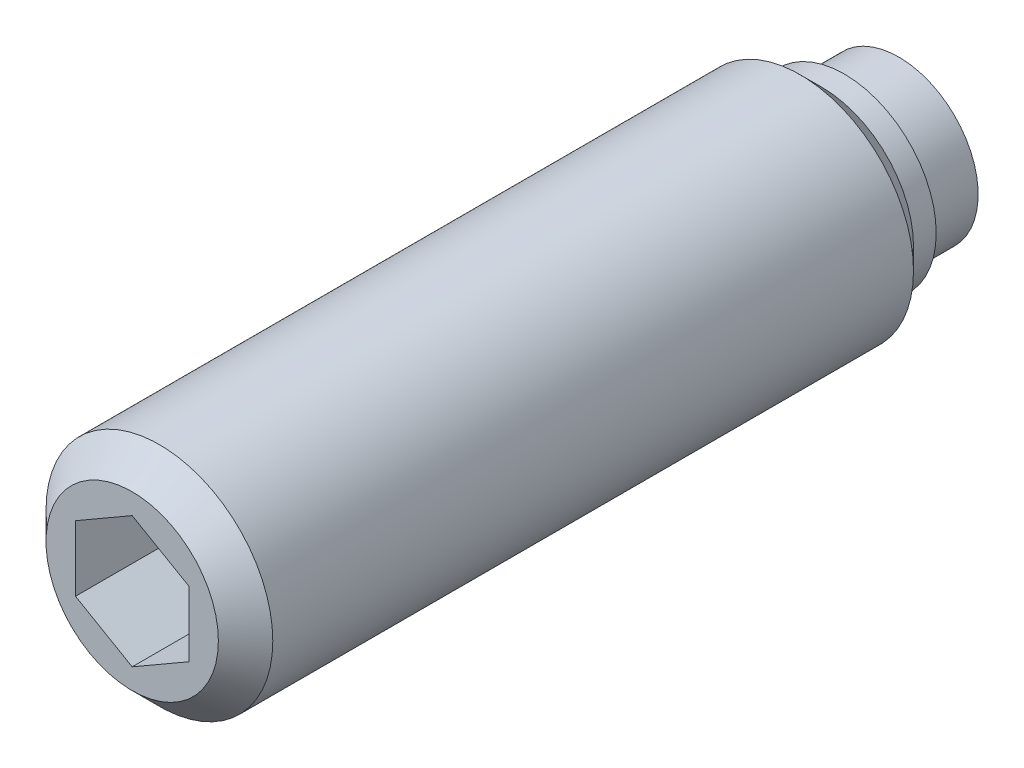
ISO-10303-21;
HEADER;
FILE_DESCRIPTION(('STEP AP214'),'2;1');
FILE_NAME('part.step','',(''),(''),'','','');
FILE_SCHEMA(('AUTOMOTIVE_DESIGN { 1 0 10303 214 1 1 1 1 }'));
ENDSEC;
DATA;
#1=APPLICATION_CONTEXT('core data for automotive mechanical design processes');
#2=APPLICATION_PROTOCOL_DEFINITION('international standard','automotive_design',2000,#1);
#3=PRODUCT_CONTEXT('',#1,'mechanical');
#4=PRODUCT('Part','Part','',(#3));
#5=PRODUCT_RELATED_PRODUCT_CATEGORY('part','',(#4));
#6=PRODUCT_DEFINITION_FORMATION('','',#4);
#7=PRODUCT_DEFINITION_CONTEXT('part definition',#1,'design');
#8=PRODUCT_DEFINITION('design','',#6,#7);
#9=PRODUCT_DEFINITION_SHAPE('','',#8);
#10=(LENGTH_UNIT() NAMED_UNIT(*) SI_UNIT(.MILLI.,.METRE.));
#11=(NAMED_UNIT(*) PLANE_ANGLE_UNIT() SI_UNIT($,.RADIAN.));
#12=(NAMED_UNIT(*) SI_UNIT($,.STERADIAN.) SOLID_ANGLE_UNIT());
#13=UNCERTAINTY_MEASURE_WITH_UNIT(LENGTH_MEASURE(1.E-05),#10,'distance_accuracy_value','');
#14=(GEOMETRIC_REPRESENTATION_CONTEXT(3) GLOBAL_UNCERTAINTY_ASSIGNED_CONTEXT((#13)) GLOBAL_UNIT_ASSIGNED_CONTEXT((#10,
#11,#12)) REPRESENTATION_CONTEXT('',''));
#15=CARTESIAN_POINT('',(0.,0.,0.));
#16=DIRECTION('',(0.,0.,1.));
#17=DIRECTION('',(1.,0.,0.));
#18=AXIS2_PLACEMENT_3D('',#15,#16,#17);
#19=CARTESIAN_POINT('',(0.,4.05,3.5));
#20=DIRECTION('',(0.,0.,1.));
#21=DIRECTION('',(1.,0.,0.));
#22=AXIS2_PLACEMENT_3D('',#19,#20,#21);
#23=PLANE('',#22);
#24=CARTESIAN_POINT('',(0.,0.,3.5));
#25=DIRECTION('',(0.,0.,-1.));
#26=DIRECTION('',(-1.,0.,0.));
#27=AXIS2_PLACEMENT_3D('',#24,#25,#26);
#28=CIRCLE('',#27,3.5);
#29=CARTESIAN_POINT('',(-3.50000000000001,0.,3.5));
#30=VERTEX_POINT('',#29);
#31=EDGE_CURVE('E124',#30,#30,#28,.T.);
#32=ORIENTED_EDGE('',*,*,#31,.F.);
#33=EDGE_LOOP('',(#32));
#34=FACE_BOUND('',#33,.T.);
#35=CARTESIAN_POINT('',(0.,0.,3.5));
#36=DIRECTION('',(0.,0.,-1.));
#37=DIRECTION('',(-1.,0.,0.));
#38=AXIS2_PLACEMENT_3D('',#35,#36,#37);
#39=CIRCLE('',#38,4.05);
#40=CARTESIAN_POINT('',(-4.05000000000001,0.,3.5));
#41=VERTEX_POINT('',#40);
#42=EDGE_CURVE('E127',#41,#41,#39,.T.);
#43=ORIENTED_EDGE('',*,*,#42,.T.);
#44=EDGE_LOOP('',(#43));
#45=FACE_BOUND('',#44,.T.);
#46=ADVANCED_FACE('F14',(#34,#45),#23,.F.);
#47=CARTESIAN_POINT('',(0.,0.,3.5));
#48=DIRECTION('',(0.,0.,-1.));
#49=DIRECTION('',(-1.,0.,0.));
#50=AXIS2_PLACEMENT_3D('',#47,#48,#49);
#51=CYLINDRICAL_SURFACE('',#50,5.);
#52=CARTESIAN_POINT('',(0.,0.,33.7));
#53=DIRECTION('',(0.,0.,1.));
#54=DIRECTION('',(1.,0.,0.));
#55=AXIS2_PLACEMENT_3D('',#52,#53,#54);
#56=CIRCLE('',#55,5.);
#57=CARTESIAN_POINT('',(4.99999999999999,0.,33.7));
#58=VERTEX_POINT('',#57);
#59=EDGE_CURVE('E9',#58,#58,#56,.F.);
#60=ORIENTED_EDGE('',*,*,#59,.T.);
#61=EDGE_LOOP('',(#60));
#62=FACE_BOUND('',#61,.T.);
#63=CARTESIAN_POINT('',(0.,0.,5.45));
#64=DIRECTION('',(0.,0.,-1.));
#65=DIRECTION('',(-1.,0.,0.));
#66=AXIS2_PLACEMENT_3D('',#63,#64,#65);
#67=CIRCLE('',#66,5.);
#68=CARTESIAN_POINT('',(-5.00000000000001,0.,5.45));
#69=VERTEX_POINT('',#68);
#70=EDGE_CURVE('E133',#69,#69,#67,.T.);
#71=ORIENTED_EDGE('',*,*,#70,.F.);
#72=EDGE_LOOP('',(#71));
#73=FACE_BOUND('',#72,.T.);
#74=ADVANCED_FACE('F151',(#62,#73),#51,.T.);
#75=CARTESIAN_POINT('',(0.,0.,5.45));
#76=DIRECTION('',(0.,0.,1.));
#77=DIRECTION('',(1.,0.,0.));
#78=AXIS2_PLACEMENT_3D('',#75,#76,#77);
#79=CONICAL_SURFACE('',#78,5.,0.785398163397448);
#80=CARTESIAN_POINT('',(0.,0.,4.5));
#81=DIRECTION('',(0.,0.,-1.));
#82=DIRECTION('',(-1.,0.,0.));
#83=AXIS2_PLACEMENT_3D('',#80,#81,#82);
#84=CIRCLE('',#83,4.05);
#85=CARTESIAN_POINT('',(-4.05000000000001,0.,4.5));
#86=VERTEX_POINT('',#85);
#87=EDGE_CURVE('E130',#86,#86,#84,.T.);
#88=ORIENTED_EDGE('',*,*,#87,.F.);
#89=EDGE_LOOP('',(#88));
#90=FACE_BOUND('',#89,.T.);
#91=ORIENTED_EDGE('',*,*,#70,.T.);
#92=EDGE_LOOP('',(#91));
#93=FACE_BOUND('',#92,.T.);
#94=ADVANCED_FACE('F158',(#90,#93),#79,.T.);
#95=CARTESIAN_POINT('',(0.,0.,3.5));
#96=DIRECTION('',(0.,0.,-1.));
#97=DIRECTION('',(-1.,0.,0.));
#98=AXIS2_PLACEMENT_3D('',#95,#96,#97);
#99=CYLINDRICAL_SURFACE('',#98,4.05);
#100=ORIENTED_EDGE('',*,*,#42,.F.);
#101=EDGE_LOOP('',(#100));
#102=FACE_BOUND('',#101,.T.);
#103=ORIENTED_EDGE('',*,*,#87,.T.);
#104=EDGE_LOOP('',(#103));
#105=FACE_BOUND('',#104,.T.);
#106=ADVANCED_FACE('F166',(#102,#105),#99,.T.);
#107=CARTESIAN_POINT('',(0.,0.,0.));
#108=DIRECTION('',(0.,0.,-1.));
#109=DIRECTION('',(-1.,0.,0.));
#110=AXIS2_PLACEMENT_3D('',#107,#108,#109);
#111=CYLINDRICAL_SURFACE('',#110,3.5);
#112=CARTESIAN_POINT('',(0.,0.,1.1));
#113=DIRECTION('',(0.,0.,-1.));
#114=DIRECTION('',(-1.,0.,0.));
#115=AXIS2_PLACEMENT_3D('',#112,#113,#114);
#116=CIRCLE('',#115,3.5);
#117=CARTESIAN_POINT('',(-3.50000000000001,0.,1.1));
#118=VERTEX_POINT('',#117);
#119=EDGE_CURVE('E114',#118,#118,#116,.T.);
#120=ORIENTED_EDGE('',*,*,#119,.F.);
#121=EDGE_LOOP('',(#120));
#122=FACE_BOUND('',#121,.T.);
#123=ORIENTED_EDGE('',*,*,#31,.T.);
#124=EDGE_LOOP('',(#123));
#125=FACE_BOUND('',#124,.T.);
#126=ADVANCED_FACE('F164',(#122,#125),#111,.T.);
#127=CARTESIAN_POINT('',(-0.0371790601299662,0.,5.9998848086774));
#128=DIRECTION('',(0.,-1.,0.));
#129=DIRECTION('',(-1.,0.,0.));
#130=AXIS2_PLACEMENT_3D('',#127,#128,#129);
#131=CIRCLE('',#130,5.99999999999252);
#132=TRIMMED_CURVE('',#131,(PARAMETER_VALUE(-1.57699287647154)),
(PARAMETER_VALUE(1.57699287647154)),.T.,.PARAMETER.);
#133=CARTESIAN_POINT('',(0.,0.,5.9998848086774));
#134=DIRECTION('',(0.,0.,-1.));
#135=AXIS1_PLACEMENT('',#133,#134);
#136=SURFACE_OF_REVOLUTION('',#132,#135);
#137=ORIENTED_EDGE('',*,*,#119,.T.);
#138=EDGE_LOOP('',(#137));
#139=FACE_BOUND('',#138,.T.);
#140=CARTESIAN_POINT('',(0.,0.,0.));
#141=VERTEX_POINT('',#140);
#142=VERTEX_LOOP('',#141);
#143=FACE_BOUND('',#142,.T.);
#144=ADVANCED_FACE('F198',(#139,#143),#136,.T.);
#145=CARTESIAN_POINT('',(0.,0.,34.9));
#146=DIRECTION('',(0.,0.,1.));
#147=DIRECTION('',(1.,0.,0.));
#148=AXIS2_PLACEMENT_3D('',#145,#146,#147);
#149=PLANE('',#148);
#150=CARTESIAN_POINT('',(0.,0.,34.9));
#151=DIRECTION('',(0.,0.,1.));
#152=DIRECTION('',(1.,0.,0.));
#153=AXIS2_PLACEMENT_3D('',#150,#151,#152);
#154=CIRCLE('',#153,3.8);
#155=CARTESIAN_POINT('',(3.79999999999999,0.,34.9));
#156=VERTEX_POINT('',#155);
#157=EDGE_CURVE('E22',#156,#156,#154,.T.);
#158=ORIENTED_EDGE('',*,*,#157,.T.);
#159=EDGE_LOOP('',(#158));
#160=FACE_BOUND('',#159,.T.);
#161=DIRECTION('',(-0.866025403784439,0.5,0.));
#162=VECTOR('',#161,1.);
#163=CARTESIAN_POINT('',(2.5,1.44337567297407,34.9));
#164=LINE('',#163,#162);
#165=CARTESIAN_POINT('',(2.5,1.44337567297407,34.9));
#166=VERTEX_POINT('',#165);
#167=CARTESIAN_POINT('',(0.,2.88675134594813,34.9));
#168=VERTEX_POINT('',#167);
#169=EDGE_CURVE('E29',#166,#168,#164,.T.);
#170=ORIENTED_EDGE('',*,*,#169,.F.);
#171=DIRECTION('',(0.,1.,0.));
#172=VECTOR('',#171,1.);
#173=CARTESIAN_POINT('',(2.5,-1.44337567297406,34.9));
#174=LINE('',#173,#172);
#175=CARTESIAN_POINT('',(2.5,-1.44337567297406,34.9));
#176=VERTEX_POINT('',#175);
#177=EDGE_CURVE('E88',#176,#166,#174,.T.);
#178=ORIENTED_EDGE('',*,*,#177,.F.);
#179=DIRECTION('',(0.866025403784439,0.5,0.));
#180=VECTOR('',#179,1.);
#181=CARTESIAN_POINT('',(0.,-2.88675134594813,34.9));
#182=LINE('',#181,#180);
#183=CARTESIAN_POINT('',(0.,-2.88675134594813,34.9));
#184=VERTEX_POINT('',#183);
#185=EDGE_CURVE('E91',#184,#176,#182,.T.);
#186=ORIENTED_EDGE('',*,*,#185,.F.);
#187=DIRECTION('',(0.866025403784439,-0.5,0.));
#188=VECTOR('',#187,1.);
#189=CARTESIAN_POINT('',(-2.5,-1.44337567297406,34.9));
#190=LINE('',#189,#188);
#191=CARTESIAN_POINT('',(-2.5,-1.44337567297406,34.9));
#192=VERTEX_POINT('',#191);
#193=EDGE_CURVE('E107',#192,#184,#190,.T.);
#194=ORIENTED_EDGE('',*,*,#193,.F.);
#195=DIRECTION('',(0.,-1.,0.));
#196=VECTOR('',#195,1.);
#197=CARTESIAN_POINT('',(-2.5,1.44337567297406,34.9));
#198=LINE('',#197,#196);
#199=CARTESIAN_POINT('',(-2.5,1.44337567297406,34.9));
#200=VERTEX_POINT('',#199);
#201=EDGE_CURVE('E104',#200,#192,#198,.T.);
#202=ORIENTED_EDGE('',*,*,#201,.F.);
#203=DIRECTION('',(-0.866025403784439,-0.5,0.));
#204=VECTOR('',#203,1.);
#205=CARTESIAN_POINT('',(0.,2.88675134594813,34.9));
#206=LINE('',#205,#204);
#207=EDGE_CURVE('E102',#168,#200,#206,.T.);
#208=ORIENTED_EDGE('',*,*,#207,.F.);
#209=EDGE_LOOP('',(#170,#178,#186,#194,#202,#208));
#210=FACE_BOUND('',#209,.T.);
#211=ADVANCED_FACE('F138',(#160,#210),#149,.T.);
#212=CARTESIAN_POINT('',(2.5,1.44337567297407,28.9));
#213=DIRECTION('',(0.5,0.866025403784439,0.));
#214=DIRECTION('',(-0.866025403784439,0.5,0.));
#215=AXIS2_PLACEMENT_3D('',#212,#213,#214);
#216=PLANE('',#215);
#217=ORIENTED_EDGE('',*,*,#169,.T.);
#218=DIRECTION('',(0.,0.,1.));
#219=VECTOR('',#218,1.);
#220=CARTESIAN_POINT('',(0.,2.88675134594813,28.9));
#221=LINE('',#220,#219);
#222=CARTESIAN_POINT('',(0.,2.88675134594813,28.9));
#223=VERTEX_POINT('',#222);
#224=EDGE_CURVE('E65',#223,#168,#221,.T.);
#225=ORIENTED_EDGE('',*,*,#224,.F.);
#226=DIRECTION('',(-0.866025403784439,0.5,0.));
#227=VECTOR('',#226,1.);
#228=CARTESIAN_POINT('',(2.5,1.44337567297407,28.9));
#229=LINE('',#228,#227);
#230=CARTESIAN_POINT('',(2.5,1.44337567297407,28.9));
#231=VERTEX_POINT('',#230);
#232=EDGE_CURVE('E69',#231,#223,#229,.T.);
#233=ORIENTED_EDGE('',*,*,#232,.F.);
#234=DIRECTION('',(0.,0.,1.));
#235=VECTOR('',#234,1.);
#236=CARTESIAN_POINT('',(2.5,1.44337567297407,28.9));
#237=LINE('',#236,#235);
#238=EDGE_CURVE('E112',#231,#166,#237,.T.);
#239=ORIENTED_EDGE('',*,*,#238,.T.);
#240=EDGE_LOOP('',(#217,#225,#233,#239));
#241=FACE_BOUND('',#240,.T.);
#242=ADVANCED_FACE('F67',(#241),#216,.F.);
#243=CARTESIAN_POINT('',(2.5,-1.44337567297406,28.9));
#244=DIRECTION('',(1.,0.,0.));
#245=DIRECTION('',(0.,0.,-1.));
#246=AXIS2_PLACEMENT_3D('',#243,#244,#245);
#247=PLANE('',#246);
#248=ORIENTED_EDGE('',*,*,#177,.T.);
#249=ORIENTED_EDGE('',*,*,#238,.F.);
#250=DIRECTION('',(0.,1.,0.));
#251=VECTOR('',#250,1.);
#252=CARTESIAN_POINT('',(2.5,-1.44337567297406,28.9));
#253=LINE('',#252,#251);
#254=CARTESIAN_POINT('',(2.5,-1.44337567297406,28.9));
#255=VERTEX_POINT('',#254);
#256=EDGE_CURVE('E75',#255,#231,#253,.T.);
#257=ORIENTED_EDGE('',*,*,#256,.F.);
#258=DIRECTION('',(0.,0.,1.));
#259=VECTOR('',#258,1.);
#260=CARTESIAN_POINT('',(2.5,-1.44337567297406,28.9));
#261=LINE('',#260,#259);
#262=EDGE_CURVE('E115',#255,#176,#261,.T.);
#263=ORIENTED_EDGE('',*,*,#262,.T.);
#264=EDGE_LOOP('',(#248,#249,#257,#263));
#265=FACE_BOUND('',#264,.T.);
#266=ADVANCED_FACE('F220',(#265),#247,.F.);
#267=CARTESIAN_POINT('',(0.,-2.88675134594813,28.9));
#268=DIRECTION('',(0.5,-0.866025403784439,0.));
#269=DIRECTION('',(0.866025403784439,0.5,0.));
#270=AXIS2_PLACEMENT_3D('',#267,#268,#269);
#271=PLANE('',#270);
#272=ORIENTED_EDGE('',*,*,#185,.T.);
#273=ORIENTED_EDGE('',*,*,#262,.F.);
#274=DIRECTION('',(0.866025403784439,0.5,0.));
#275=VECTOR('',#274,1.);
#276=CARTESIAN_POINT('',(0.,-2.88675134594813,28.9));
#277=LINE('',#276,#275);
#278=CARTESIAN_POINT('',(0.,-2.88675134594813,28.9));
#279=VERTEX_POINT('',#278);
#280=EDGE_CURVE('E98',#279,#255,#277,.T.);
#281=ORIENTED_EDGE('',*,*,#280,.F.);
#282=DIRECTION('',(0.,0.,1.));
#283=VECTOR('',#282,1.);
#284=CARTESIAN_POINT('',(0.,-2.88675134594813,28.9));
#285=LINE('',#284,#283);
#286=EDGE_CURVE('E117',#279,#184,#285,.T.);
#287=ORIENTED_EDGE('',*,*,#286,.T.);
#288=EDGE_LOOP('',(#272,#273,#281,#287));
#289=FACE_BOUND('',#288,.T.);
#290=ADVANCED_FACE('F228',(#289),#271,.F.);
#291=CARTESIAN_POINT('',(-2.5,-1.44337567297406,28.9));
#292=DIRECTION('',(-0.5,-0.866025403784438,0.));
#293=DIRECTION('',(0.866025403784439,-0.5,0.));
#294=AXIS2_PLACEMENT_3D('',#291,#292,#293);
#295=PLANE('',#294);
#296=ORIENTED_EDGE('',*,*,#193,.T.);
#297=ORIENTED_EDGE('',*,*,#286,.F.);
#298=DIRECTION('',(0.866025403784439,-0.5,0.));
#299=VECTOR('',#298,1.);
#300=CARTESIAN_POINT('',(-2.5,-1.44337567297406,28.9));
#301=LINE('',#300,#299);
#302=CARTESIAN_POINT('',(-2.5,-1.44337567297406,28.9));
#303=VERTEX_POINT('',#302);
#304=EDGE_CURVE('E95',#303,#279,#301,.T.);
#305=ORIENTED_EDGE('',*,*,#304,.F.);
#306=DIRECTION('',(0.,0.,1.));
#307=VECTOR('',#306,1.);
#308=CARTESIAN_POINT('',(-2.5,-1.44337567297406,28.9));
#309=LINE('',#308,#307);
#310=EDGE_CURVE('E119',#303,#192,#309,.T.);
#311=ORIENTED_EDGE('',*,*,#310,.T.);
#312=EDGE_LOOP('',(#296,#297,#305,#311));
#313=FACE_BOUND('',#312,.T.);
#314=ADVANCED_FACE('F237',(#313),#295,.F.);
#315=CARTESIAN_POINT('',(-2.5,1.44337567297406,28.9));
#316=DIRECTION('',(-1.,0.,0.));
#317=DIRECTION('',(0.,0.,1.));
#318=AXIS2_PLACEMENT_3D('',#315,#316,#317);
#319=PLANE('',#318);
#320=ORIENTED_EDGE('',*,*,#201,.T.);
#321=ORIENTED_EDGE('',*,*,#310,.F.);
#322=DIRECTION('',(0.,-1.,0.));
#323=VECTOR('',#322,1.);
#324=CARTESIAN_POINT('',(-2.5,1.44337567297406,28.9));
#325=LINE('',#324,#323);
#326=CARTESIAN_POINT('',(-2.5,1.44337567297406,28.9));
#327=VERTEX_POINT('',#326);
#328=EDGE_CURVE('E83',#327,#303,#325,.T.);
#329=ORIENTED_EDGE('',*,*,#328,.F.);
#330=DIRECTION('',(0.,0.,1.));
#331=VECTOR('',#330,1.);
#332=CARTESIAN_POINT('',(-2.5,1.44337567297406,28.9));
#333=LINE('',#332,#331);
#334=EDGE_CURVE('E74',#327,#200,#333,.T.);
#335=ORIENTED_EDGE('',*,*,#334,.T.);
#336=EDGE_LOOP('',(#320,#321,#329,#335));
#337=FACE_BOUND('',#336,.T.);
#338=ADVANCED_FACE('F246',(#337),#319,.F.);
#339=CARTESIAN_POINT('',(0.,2.88675134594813,28.9));
#340=DIRECTION('',(-0.5,0.866025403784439,0.));
#341=DIRECTION('',(-0.866025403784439,-0.5,0.));
#342=AXIS2_PLACEMENT_3D('',#339,#340,#341);
#343=PLANE('',#342);
#344=ORIENTED_EDGE('',*,*,#207,.T.);
#345=ORIENTED_EDGE('',*,*,#334,.F.);
#346=DIRECTION('',(-0.866025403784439,-0.5,0.));
#347=VECTOR('',#346,1.);
#348=CARTESIAN_POINT('',(0.,2.88675134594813,28.9));
#349=LINE('',#348,#347);
#350=EDGE_CURVE('E78',#223,#327,#349,.T.);
#351=ORIENTED_EDGE('',*,*,#350,.F.);
#352=ORIENTED_EDGE('',*,*,#224,.T.);
#353=EDGE_LOOP('',(#344,#345,#351,#352));
#354=FACE_BOUND('',#353,.T.);
#355=ADVANCED_FACE('F79',(#354),#343,.F.);
#356=CARTESIAN_POINT('',(0.,0.,28.9));
#357=DIRECTION('',(0.,0.,1.));
#358=DIRECTION('',(1.,0.,0.));
#359=AXIS2_PLACEMENT_3D('',#356,#357,#358);
#360=PLANE('',#359);
#361=ORIENTED_EDGE('',*,*,#232,.T.);
#362=ORIENTED_EDGE('',*,*,#350,.T.);
#363=ORIENTED_EDGE('',*,*,#328,.T.);
#364=ORIENTED_EDGE('',*,*,#304,.T.);
#365=ORIENTED_EDGE('',*,*,#280,.T.);
#366=ORIENTED_EDGE('',*,*,#256,.T.);
#367=EDGE_LOOP('',(#361,#362,#363,#364,#365,#366));
#368=FACE_BOUND('',#367,.T.);
#369=ADVANCED_FACE('F85',(#368),#360,.T.);
#370=CARTESIAN_POINT('',(0.,0.,34.9));
#371=DIRECTION('',(0.,0.,-1.));
#372=DIRECTION('',(-1.,0.,0.));
#373=AXIS2_PLACEMENT_3D('',#370,#371,#372);
#374=CONICAL_SURFACE('',#373,3.8,0.785398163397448);
#375=ORIENTED_EDGE('',*,*,#59,.F.);
#376=EDGE_LOOP('',(#375));
#377=FACE_BOUND('',#376,.T.);
#378=ORIENTED_EDGE('',*,*,#157,.F.);
#379=EDGE_LOOP('',(#378));
#380=FACE_BOUND('',#379,.T.);
#381=ADVANCED_FACE('F16',(#377,#380),#374,.T.);
#382=CLOSED_SHELL('',(#46,#74,#94,#106,#126,#144,#211,#242,#266,#290,#314,#338,#355,#369,#381));
#383=MANIFOLD_SOLID_BREP('B1',#382);
#384=ADVANCED_BREP_SHAPE_REPRESENTATION('',(#18,#383),#14);
#385=SHAPE_DEFINITION_REPRESENTATION(#9,#384);
ENDSEC;
END-ISO-10303-21;
